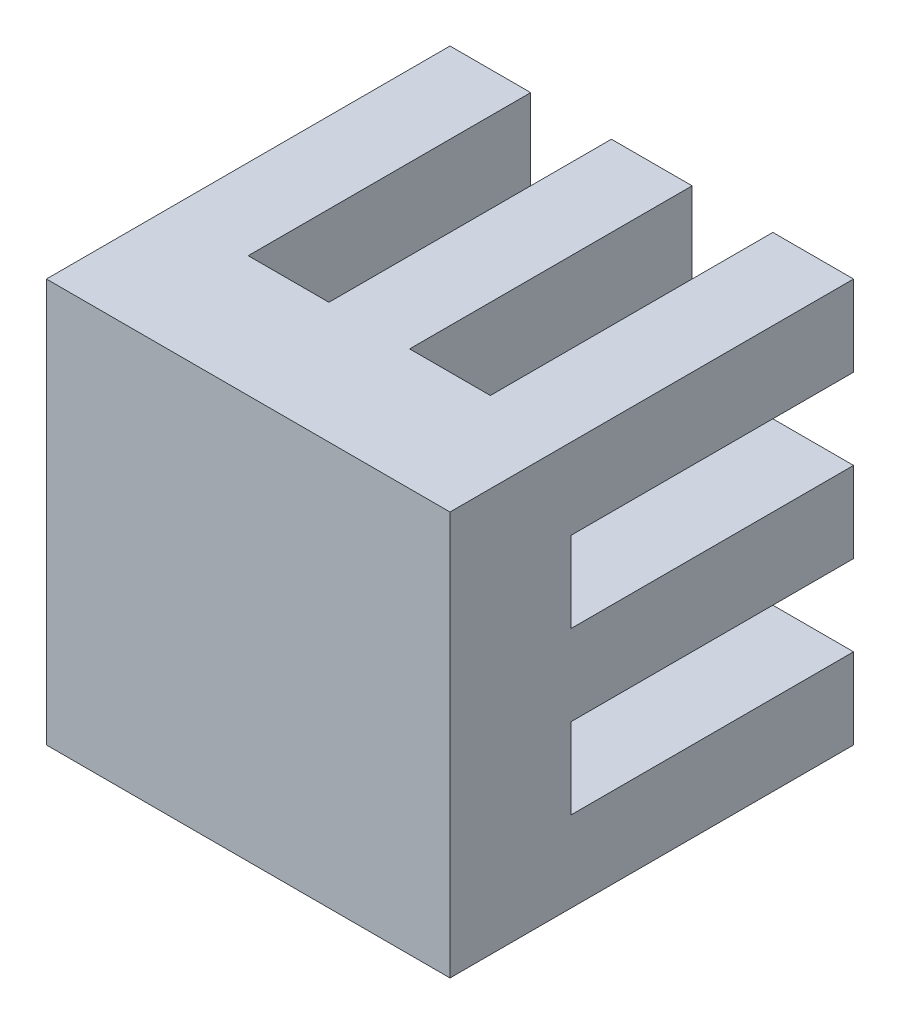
ISO-10303-21;
HEADER;
FILE_DESCRIPTION(('STEP AP214'),'2;1');
FILE_NAME('part.step','',(''),(''),'','','');
FILE_SCHEMA(('AUTOMOTIVE_DESIGN { 1 0 10303 214 1 1 1 1 }'));
ENDSEC;
DATA;
#1=APPLICATION_CONTEXT('core data for automotive mechanical design processes');
#2=APPLICATION_PROTOCOL_DEFINITION('international standard','automotive_design',2000,#1);
#3=PRODUCT_CONTEXT('',#1,'mechanical');
#4=PRODUCT('Part','Part','',(#3));
#5=PRODUCT_RELATED_PRODUCT_CATEGORY('part','',(#4));
#6=PRODUCT_DEFINITION_FORMATION('','',#4);
#7=PRODUCT_DEFINITION_CONTEXT('part definition',#1,'design');
#8=PRODUCT_DEFINITION('design','',#6,#7);
#9=PRODUCT_DEFINITION_SHAPE('','',#8);
#10=(LENGTH_UNIT() NAMED_UNIT(*) SI_UNIT(.MILLI.,.METRE.));
#11=(NAMED_UNIT(*) PLANE_ANGLE_UNIT() SI_UNIT($,.RADIAN.));
#12=(NAMED_UNIT(*) SI_UNIT($,.STERADIAN.) SOLID_ANGLE_UNIT());
#13=UNCERTAINTY_MEASURE_WITH_UNIT(LENGTH_MEASURE(1.E-05),#10,'distance_accuracy_value','');
#14=(GEOMETRIC_REPRESENTATION_CONTEXT(3) GLOBAL_UNCERTAINTY_ASSIGNED_CONTEXT((#13)) GLOBAL_UNIT_ASSIGNED_CONTEXT((#10,
#11,#12)) REPRESENTATION_CONTEXT('',''));
#15=CARTESIAN_POINT('',(0.,0.,0.));
#16=DIRECTION('',(0.,0.,1.));
#17=DIRECTION('',(1.,0.,0.));
#18=AXIS2_PLACEMENT_3D('',#15,#16,#17);
#19=CARTESIAN_POINT('',(0.,10.,0.));
#20=DIRECTION('',(0.,0.,1.));
#21=DIRECTION('',(1.,0.,0.));
#22=AXIS2_PLACEMENT_3D('',#19,#20,#21);
#23=PLANE('',#22);
#24=DIRECTION('',(0.,1.,0.));
#25=VECTOR('',#24,1.);
#26=CARTESIAN_POINT('',(6.,0.,0.));
#27=LINE('',#26,#25);
#28=CARTESIAN_POINT('',(6.,8.,0.));
#29=VERTEX_POINT('',#28);
#30=CARTESIAN_POINT('',(6.,10.,0.));
#31=VERTEX_POINT('',#30);
#32=EDGE_CURVE('E405',#29,#31,#27,.T.);
#33=ORIENTED_EDGE('',*,*,#32,.F.);
#34=DIRECTION('',(1.,0.,0.));
#35=VECTOR('',#34,1.);
#36=CARTESIAN_POINT('',(10.,8.,0.));
#37=LINE('',#36,#35);
#38=CARTESIAN_POINT('',(4.,8.,0.));
#39=VERTEX_POINT('',#38);
#40=EDGE_CURVE('E554',#39,#29,#37,.T.);
#41=ORIENTED_EDGE('',*,*,#40,.F.);
#42=DIRECTION('',(0.,1.,0.));
#43=VECTOR('',#42,1.);
#44=CARTESIAN_POINT('',(4.,0.,0.));
#45=LINE('',#44,#43);
#46=CARTESIAN_POINT('',(4.,10.,0.));
#47=VERTEX_POINT('',#46);
#48=EDGE_CURVE('E448',#39,#47,#45,.T.);
#49=ORIENTED_EDGE('',*,*,#48,.T.);
#50=DIRECTION('',(-1.,0.,0.));
#51=VECTOR('',#50,1.);
#52=CARTESIAN_POINT('',(0.,10.,0.));
#53=LINE('',#52,#51);
#54=EDGE_CURVE('E471',#31,#47,#53,.T.);
#55=ORIENTED_EDGE('',*,*,#54,.F.);
#56=EDGE_LOOP('',(#33,#41,#49,#55));
#57=FACE_BOUND('',#56,.T.);
#58=ADVANCED_FACE('F34',(#57),#23,.F.);
#59=DIRECTION('',(0.,1.,0.));
#60=VECTOR('',#59,1.);
#61=CARTESIAN_POINT('',(2.,0.,0.));
#62=LINE('',#61,#60);
#63=CARTESIAN_POINT('',(2.,8.,0.));
#64=VERTEX_POINT('',#63);
#65=CARTESIAN_POINT('',(2.,10.,0.));
#66=VERTEX_POINT('',#65);
#67=EDGE_CURVE('E443',#64,#66,#62,.T.);
#68=ORIENTED_EDGE('',*,*,#67,.F.);
#69=CARTESIAN_POINT('',(0.,8.,0.));
#70=VERTEX_POINT('',#69);
#71=EDGE_CURVE('E289',#70,#64,#37,.T.);
#72=ORIENTED_EDGE('',*,*,#71,.F.);
#73=DIRECTION('',(0.,-1.,0.));
#74=VECTOR('',#73,1.);
#75=CARTESIAN_POINT('',(0.,10.,0.));
#76=LINE('',#75,#74);
#77=CARTESIAN_POINT('',(0.,10.,0.));
#78=VERTEX_POINT('',#77);
#79=EDGE_CURVE('E483',#78,#70,#76,.T.);
#80=ORIENTED_EDGE('',*,*,#79,.F.);
#81=EDGE_CURVE('E466',#66,#78,#53,.T.);
#82=ORIENTED_EDGE('',*,*,#81,.F.);
#83=EDGE_LOOP('',(#68,#72,#80,#82));
#84=FACE_BOUND('',#83,.T.);
#85=ADVANCED_FACE('F573',(#84),#23,.F.);
#86=DIRECTION('',(0.,-1.,0.));
#87=VECTOR('',#86,1.);
#88=CARTESIAN_POINT('',(10.,10.,0.));
#89=LINE('',#88,#87);
#90=CARTESIAN_POINT('',(10.,10.,0.));
#91=VERTEX_POINT('',#90);
#92=CARTESIAN_POINT('',(10.,8.,0.));
#93=VERTEX_POINT('',#92);
#94=EDGE_CURVE('E488',#91,#93,#89,.T.);
#95=ORIENTED_EDGE('',*,*,#94,.T.);
#96=CARTESIAN_POINT('',(8.,8.,0.));
#97=VERTEX_POINT('',#96);
#98=EDGE_CURVE('E553',#97,#93,#37,.T.);
#99=ORIENTED_EDGE('',*,*,#98,.F.);
#100=DIRECTION('',(0.,1.,0.));
#101=VECTOR('',#100,1.);
#102=CARTESIAN_POINT('',(8.,0.,0.));
#103=LINE('',#102,#101);
#104=CARTESIAN_POINT('',(8.,10.,0.));
#105=VERTEX_POINT('',#104);
#106=EDGE_CURVE('E410',#97,#105,#103,.T.);
#107=ORIENTED_EDGE('',*,*,#106,.T.);
#108=EDGE_CURVE('E467',#91,#105,#53,.T.);
#109=ORIENTED_EDGE('',*,*,#108,.F.);
#110=EDGE_LOOP('',(#95,#99,#107,#109));
#111=FACE_BOUND('',#110,.T.);
#112=ADVANCED_FACE('F552',(#111),#23,.F.);
#113=CARTESIAN_POINT('',(2.,0.,0.));
#114=DIRECTION('',(-1.,0.,0.));
#115=DIRECTION('',(0.,0.,1.));
#116=AXIS2_PLACEMENT_3D('',#113,#114,#115);
#117=PLANE('',#116);
#118=DIRECTION('',(0.,1.,0.));
#119=VECTOR('',#118,1.);
#120=CARTESIAN_POINT('',(2.,0.,7.));
#121=LINE('',#120,#119);
#122=CARTESIAN_POINT('',(2.,8.,7.));
#123=VERTEX_POINT('',#122);
#124=CARTESIAN_POINT('',(2.,10.,7.));
#125=VERTEX_POINT('',#124);
#126=EDGE_CURVE('E430',#123,#125,#121,.T.);
#127=ORIENTED_EDGE('',*,*,#126,.F.);
#128=DIRECTION('',(0.,0.,-1.));
#129=VECTOR('',#128,1.);
#130=CARTESIAN_POINT('',(2.,8.,0.));
#131=LINE('',#130,#129);
#132=EDGE_CURVE('E323',#123,#64,#131,.T.);
#133=ORIENTED_EDGE('',*,*,#132,.T.);
#134=ORIENTED_EDGE('',*,*,#67,.T.);
#135=DIRECTION('',(0.,0.,1.));
#136=VECTOR('',#135,1.);
#137=CARTESIAN_POINT('',(2.,10.,0.));
#138=LINE('',#137,#136);
#139=EDGE_CURVE('E403',#66,#125,#138,.T.);
#140=ORIENTED_EDGE('',*,*,#139,.T.);
#141=EDGE_LOOP('',(#127,#133,#134,#140));
#142=FACE_BOUND('',#141,.T.);
#143=ADVANCED_FACE('F570',(#142),#117,.F.);
#144=CARTESIAN_POINT('',(4.,0.,0.));
#145=DIRECTION('',(1.,0.,0.));
#146=DIRECTION('',(0.,0.,-1.));
#147=AXIS2_PLACEMENT_3D('',#144,#145,#146);
#148=PLANE('',#147);
#149=ORIENTED_EDGE('',*,*,#48,.F.);
#150=DIRECTION('',(0.,0.,1.));
#151=VECTOR('',#150,1.);
#152=CARTESIAN_POINT('',(4.,8.,0.));
#153=LINE('',#152,#151);
#154=CARTESIAN_POINT('',(4.,8.,7.));
#155=VERTEX_POINT('',#154);
#156=EDGE_CURVE('E320',#39,#155,#153,.T.);
#157=ORIENTED_EDGE('',*,*,#156,.T.);
#158=DIRECTION('',(0.,1.,0.));
#159=VECTOR('',#158,1.);
#160=CARTESIAN_POINT('',(4.,0.,7.));
#161=LINE('',#160,#159);
#162=CARTESIAN_POINT('',(4.,10.,7.));
#163=VERTEX_POINT('',#162);
#164=EDGE_CURVE('E453',#155,#163,#161,.T.);
#165=ORIENTED_EDGE('',*,*,#164,.T.);
#166=DIRECTION('',(0.,0.,-1.));
#167=VECTOR('',#166,1.);
#168=CARTESIAN_POINT('',(4.,10.,0.));
#169=LINE('',#168,#167);
#170=EDGE_CURVE('E424',#163,#47,#169,.T.);
#171=ORIENTED_EDGE('',*,*,#170,.T.);
#172=EDGE_LOOP('',(#149,#157,#165,#171));
#173=FACE_BOUND('',#172,.T.);
#174=ADVANCED_FACE('F596',(#173),#148,.F.);
#175=CARTESIAN_POINT('',(6.,0.,0.));
#176=DIRECTION('',(-1.,0.,0.));
#177=DIRECTION('',(0.,0.,1.));
#178=AXIS2_PLACEMENT_3D('',#175,#176,#177);
#179=PLANE('',#178);
#180=DIRECTION('',(0.,1.,0.));
#181=VECTOR('',#180,1.);
#182=CARTESIAN_POINT('',(6.,0.,7.));
#183=LINE('',#182,#181);
#184=CARTESIAN_POINT('',(6.,8.,7.));
#185=VERTEX_POINT('',#184);
#186=CARTESIAN_POINT('',(6.,10.,7.));
#187=VERTEX_POINT('',#186);
#188=EDGE_CURVE('E392',#185,#187,#183,.T.);
#189=ORIENTED_EDGE('',*,*,#188,.F.);
#190=DIRECTION('',(0.,0.,-1.));
#191=VECTOR('',#190,1.);
#192=CARTESIAN_POINT('',(6.,8.,0.));
#193=LINE('',#192,#191);
#194=EDGE_CURVE('E317',#185,#29,#193,.T.);
#195=ORIENTED_EDGE('',*,*,#194,.T.);
#196=ORIENTED_EDGE('',*,*,#32,.T.);
#197=DIRECTION('',(0.,0.,1.));
#198=VECTOR('',#197,1.);
#199=CARTESIAN_POINT('',(6.,10.,0.));
#200=LINE('',#199,#198);
#201=EDGE_CURVE('E381',#31,#187,#200,.T.);
#202=ORIENTED_EDGE('',*,*,#201,.T.);
#203=EDGE_LOOP('',(#189,#195,#196,#202));
#204=FACE_BOUND('',#203,.T.);
#205=ADVANCED_FACE('F538',(#204),#179,.F.);
#206=CARTESIAN_POINT('',(8.,0.,0.));
#207=DIRECTION('',(1.,0.,0.));
#208=DIRECTION('',(0.,0.,-1.));
#209=AXIS2_PLACEMENT_3D('',#206,#207,#208);
#210=PLANE('',#209);
#211=ORIENTED_EDGE('',*,*,#106,.F.);
#212=DIRECTION('',(0.,0.,1.));
#213=VECTOR('',#212,1.);
#214=CARTESIAN_POINT('',(8.,8.,0.));
#215=LINE('',#214,#213);
#216=CARTESIAN_POINT('',(8.,8.,7.));
#217=VERTEX_POINT('',#216);
#218=EDGE_CURVE('E314',#97,#217,#215,.T.);
#219=ORIENTED_EDGE('',*,*,#218,.T.);
#220=DIRECTION('',(0.,1.,0.));
#221=VECTOR('',#220,1.);
#222=CARTESIAN_POINT('',(8.,0.,7.));
#223=LINE('',#222,#221);
#224=CARTESIAN_POINT('',(8.,10.,7.));
#225=VERTEX_POINT('',#224);
#226=EDGE_CURVE('E415',#217,#225,#223,.T.);
#227=ORIENTED_EDGE('',*,*,#226,.T.);
#228=DIRECTION('',(0.,0.,-1.));
#229=VECTOR('',#228,1.);
#230=CARTESIAN_POINT('',(8.,10.,0.));
#231=LINE('',#230,#229);
#232=EDGE_CURVE('E386',#225,#105,#231,.T.);
#233=ORIENTED_EDGE('',*,*,#232,.T.);
#234=EDGE_LOOP('',(#211,#219,#227,#233));
#235=FACE_BOUND('',#234,.T.);
#236=ADVANCED_FACE('F547',(#235),#210,.F.);
#237=CARTESIAN_POINT('',(4.,4.,0.));
#238=VERTEX_POINT('',#237);
#239=CARTESIAN_POINT('',(4.,6.,0.));
#240=VERTEX_POINT('',#239);
#241=EDGE_CURVE('E447',#238,#240,#45,.T.);
#242=ORIENTED_EDGE('',*,*,#241,.T.);
#243=DIRECTION('',(-1.,0.,0.));
#244=VECTOR('',#243,1.);
#245=CARTESIAN_POINT('',(10.,6.,0.));
#246=LINE('',#245,#244);
#247=CARTESIAN_POINT('',(6.,6.,0.));
#248=VERTEX_POINT('',#247);
#249=EDGE_CURVE('E556',#248,#240,#246,.T.);
#250=ORIENTED_EDGE('',*,*,#249,.F.);
#251=CARTESIAN_POINT('',(6.,4.,0.));
#252=VERTEX_POINT('',#251);
#253=EDGE_CURVE('E404',#252,#248,#27,.T.);
#254=ORIENTED_EDGE('',*,*,#253,.F.);
#255=DIRECTION('',(1.,0.,0.));
#256=VECTOR('',#255,1.);
#257=CARTESIAN_POINT('',(10.,4.,0.));
#258=LINE('',#257,#256);
#259=EDGE_CURVE('E347',#238,#252,#258,.T.);
#260=ORIENTED_EDGE('',*,*,#259,.F.);
#261=EDGE_LOOP('',(#242,#250,#254,#260));
#262=FACE_BOUND('',#261,.T.);
#263=ADVANCED_FACE('F671',(#262),#23,.F.);
#264=CARTESIAN_POINT('',(0.,6.,0.));
#265=VERTEX_POINT('',#264);
#266=CARTESIAN_POINT('',(0.,4.,0.));
#267=VERTEX_POINT('',#266);
#268=EDGE_CURVE('E487',#265,#267,#76,.T.);
#269=ORIENTED_EDGE('',*,*,#268,.F.);
#270=CARTESIAN_POINT('',(2.,6.,0.));
#271=VERTEX_POINT('',#270);
#272=EDGE_CURVE('E558',#271,#265,#246,.T.);
#273=ORIENTED_EDGE('',*,*,#272,.F.);
#274=CARTESIAN_POINT('',(2.,4.,0.));
#275=VERTEX_POINT('',#274);
#276=EDGE_CURVE('E442',#275,#271,#62,.T.);
#277=ORIENTED_EDGE('',*,*,#276,.F.);
#278=EDGE_CURVE('E331',#267,#275,#258,.T.);
#279=ORIENTED_EDGE('',*,*,#278,.F.);
#280=EDGE_LOOP('',(#269,#273,#277,#279));
#281=FACE_BOUND('',#280,.T.);
#282=ADVANCED_FACE('F585',(#281),#23,.F.);
#283=CARTESIAN_POINT('',(8.,4.,0.));
#284=VERTEX_POINT('',#283);
#285=CARTESIAN_POINT('',(8.,6.,0.));
#286=VERTEX_POINT('',#285);
#287=EDGE_CURVE('E409',#284,#286,#103,.T.);
#288=ORIENTED_EDGE('',*,*,#287,.T.);
#289=CARTESIAN_POINT('',(10.,6.,0.));
#290=VERTEX_POINT('',#289);
#291=EDGE_CURVE('E512',#290,#286,#246,.T.);
#292=ORIENTED_EDGE('',*,*,#291,.F.);
#293=CARTESIAN_POINT('',(10.,4.,0.));
#294=VERTEX_POINT('',#293);
#295=EDGE_CURVE('E294',#290,#294,#89,.T.);
#296=ORIENTED_EDGE('',*,*,#295,.T.);
#297=EDGE_CURVE('E344',#284,#294,#258,.T.);
#298=ORIENTED_EDGE('',*,*,#297,.F.);
#299=EDGE_LOOP('',(#288,#292,#296,#298));
#300=FACE_BOUND('',#299,.T.);
#301=ADVANCED_FACE('F510',(#300),#23,.F.);
#302=ORIENTED_EDGE('',*,*,#276,.T.);
#303=DIRECTION('',(0.,0.,1.));
#304=VECTOR('',#303,1.);
#305=CARTESIAN_POINT('',(2.,6.,0.));
#306=LINE('',#305,#304);
#307=CARTESIAN_POINT('',(2.,6.,7.));
#308=VERTEX_POINT('',#307);
#309=EDGE_CURVE('E311',#271,#308,#306,.T.);
#310=ORIENTED_EDGE('',*,*,#309,.T.);
#311=CARTESIAN_POINT('',(2.,4.,7.));
#312=VERTEX_POINT('',#311);
#313=EDGE_CURVE('E457',#312,#308,#121,.T.);
#314=ORIENTED_EDGE('',*,*,#313,.F.);
#315=DIRECTION('',(0.,0.,-1.));
#316=VECTOR('',#315,1.);
#317=CARTESIAN_POINT('',(2.,4.,0.));
#318=LINE('',#317,#316);
#319=EDGE_CURVE('E378',#312,#275,#318,.T.);
#320=ORIENTED_EDGE('',*,*,#319,.T.);
#321=EDGE_LOOP('',(#302,#310,#314,#320));
#322=FACE_BOUND('',#321,.T.);
#323=ADVANCED_FACE('F577',(#322),#117,.F.);
#324=CARTESIAN_POINT('',(4.,4.,7.));
#325=VERTEX_POINT('',#324);
#326=CARTESIAN_POINT('',(4.,6.,7.));
#327=VERTEX_POINT('',#326);
#328=EDGE_CURVE('E452',#325,#327,#161,.T.);
#329=ORIENTED_EDGE('',*,*,#328,.T.);
#330=DIRECTION('',(0.,0.,-1.));
#331=VECTOR('',#330,1.);
#332=CARTESIAN_POINT('',(4.,6.,0.));
#333=LINE('',#332,#331);
#334=EDGE_CURVE('E308',#327,#240,#333,.T.);
#335=ORIENTED_EDGE('',*,*,#334,.T.);
#336=ORIENTED_EDGE('',*,*,#241,.F.);
#337=DIRECTION('',(0.,0.,1.));
#338=VECTOR('',#337,1.);
#339=CARTESIAN_POINT('',(4.,4.,0.));
#340=LINE('',#339,#338);
#341=EDGE_CURVE('E375',#238,#325,#340,.T.);
#342=ORIENTED_EDGE('',*,*,#341,.T.);
#343=EDGE_LOOP('',(#329,#335,#336,#342));
#344=FACE_BOUND('',#343,.T.);
#345=ADVANCED_FACE('F668',(#344),#148,.F.);
#346=ORIENTED_EDGE('',*,*,#253,.T.);
#347=DIRECTION('',(0.,0.,1.));
#348=VECTOR('',#347,1.);
#349=CARTESIAN_POINT('',(6.,6.,0.));
#350=LINE('',#349,#348);
#351=CARTESIAN_POINT('',(6.,6.,7.));
#352=VERTEX_POINT('',#351);
#353=EDGE_CURVE('E305',#248,#352,#350,.T.);
#354=ORIENTED_EDGE('',*,*,#353,.T.);
#355=CARTESIAN_POINT('',(6.,4.,7.));
#356=VERTEX_POINT('',#355);
#357=EDGE_CURVE('E419',#356,#352,#183,.T.);
#358=ORIENTED_EDGE('',*,*,#357,.F.);
#359=DIRECTION('',(0.,0.,-1.));
#360=VECTOR('',#359,1.);
#361=CARTESIAN_POINT('',(6.,4.,0.));
#362=LINE('',#361,#360);
#363=EDGE_CURVE('E372',#356,#252,#362,.T.);
#364=ORIENTED_EDGE('',*,*,#363,.T.);
#365=EDGE_LOOP('',(#346,#354,#358,#364));
#366=FACE_BOUND('',#365,.T.);
#367=ADVANCED_FACE('F531',(#366),#179,.F.);
#368=CARTESIAN_POINT('',(8.,4.,7.));
#369=VERTEX_POINT('',#368);
#370=CARTESIAN_POINT('',(8.,6.,7.));
#371=VERTEX_POINT('',#370);
#372=EDGE_CURVE('E414',#369,#371,#223,.T.);
#373=ORIENTED_EDGE('',*,*,#372,.T.);
#374=DIRECTION('',(0.,0.,-1.));
#375=VECTOR('',#374,1.);
#376=CARTESIAN_POINT('',(8.,6.,0.));
#377=LINE('',#376,#375);
#378=EDGE_CURVE('E273',#371,#286,#377,.T.);
#379=ORIENTED_EDGE('',*,*,#378,.T.);
#380=ORIENTED_EDGE('',*,*,#287,.F.);
#381=DIRECTION('',(0.,0.,1.));
#382=VECTOR('',#381,1.);
#383=CARTESIAN_POINT('',(8.,4.,0.));
#384=LINE('',#383,#382);
#385=EDGE_CURVE('E369',#284,#369,#384,.T.);
#386=ORIENTED_EDGE('',*,*,#385,.T.);
#387=EDGE_LOOP('',(#373,#379,#380,#386));
#388=FACE_BOUND('',#387,.T.);
#389=ADVANCED_FACE('F549',(#388),#210,.F.);
#390=CARTESIAN_POINT('',(4.,0.,0.));
#391=VERTEX_POINT('',#390);
#392=CARTESIAN_POINT('',(4.,2.,0.));
#393=VERTEX_POINT('',#392);
#394=EDGE_CURVE('E444',#391,#393,#45,.T.);
#395=ORIENTED_EDGE('',*,*,#394,.T.);
#396=DIRECTION('',(-1.,0.,0.));
#397=VECTOR('',#396,1.);
#398=CARTESIAN_POINT('',(10.,2.,0.));
#399=LINE('',#398,#397);
#400=CARTESIAN_POINT('',(6.,2.,0.));
#401=VERTEX_POINT('',#400);
#402=EDGE_CURVE('E345',#401,#393,#399,.T.);
#403=ORIENTED_EDGE('',*,*,#402,.F.);
#404=CARTESIAN_POINT('',(6.,0.,0.));
#405=VERTEX_POINT('',#404);
#406=EDGE_CURVE('E400',#405,#401,#27,.T.);
#407=ORIENTED_EDGE('',*,*,#406,.F.);
#408=DIRECTION('',(-1.,0.,0.));
#409=VECTOR('',#408,1.);
#410=CARTESIAN_POINT('',(0.,0.,0.));
#411=LINE('',#410,#409);
#412=EDGE_CURVE('E482',#405,#391,#411,.T.);
#413=ORIENTED_EDGE('',*,*,#412,.T.);
#414=EDGE_LOOP('',(#395,#403,#407,#413));
#415=FACE_BOUND('',#414,.T.);
#416=ADVANCED_FACE('F613',(#415),#23,.F.);
#417=CARTESIAN_POINT('',(0.,2.,0.));
#418=VERTEX_POINT('',#417);
#419=CARTESIAN_POINT('',(0.,0.,0.));
#420=VERTEX_POINT('',#419);
#421=EDGE_CURVE('E470',#418,#420,#76,.T.);
#422=ORIENTED_EDGE('',*,*,#421,.F.);
#423=CARTESIAN_POINT('',(2.,2.,0.));
#424=VERTEX_POINT('',#423);
#425=EDGE_CURVE('E326',#424,#418,#399,.T.);
#426=ORIENTED_EDGE('',*,*,#425,.F.);
#427=CARTESIAN_POINT('',(2.,0.,0.));
#428=VERTEX_POINT('',#427);
#429=EDGE_CURVE('E438',#428,#424,#62,.T.);
#430=ORIENTED_EDGE('',*,*,#429,.F.);
#431=EDGE_CURVE('E479',#428,#420,#411,.T.);
#432=ORIENTED_EDGE('',*,*,#431,.T.);
#433=EDGE_LOOP('',(#422,#426,#430,#432));
#434=FACE_BOUND('',#433,.T.);
#435=ADVANCED_FACE('F609',(#434),#23,.F.);
#436=CARTESIAN_POINT('',(0.,10.,0.));
#437=DIRECTION('',(1.,0.,0.));
#438=DIRECTION('',(0.,0.,-1.));
#439=AXIS2_PLACEMENT_3D('',#436,#437,#438);
#440=PLANE('',#439);
#441=ORIENTED_EDGE('',*,*,#79,.T.);
#442=DIRECTION('',(0.,0.,-1.));
#443=VECTOR('',#442,1.);
#444=CARTESIAN_POINT('',(0.,8.,7.));
#445=LINE('',#444,#443);
#446=CARTESIAN_POINT('',(0.,8.,7.));
#447=VERTEX_POINT('',#446);
#448=EDGE_CURVE('E297',#447,#70,#445,.T.);
#449=ORIENTED_EDGE('',*,*,#448,.F.);
#450=DIRECTION('',(0.,1.,0.));
#451=VECTOR('',#450,1.);
#452=CARTESIAN_POINT('',(0.,8.,7.));
#453=LINE('',#452,#451);
#454=CARTESIAN_POINT('',(0.,6.,7.));
#455=VERTEX_POINT('',#454);
#456=EDGE_CURVE('E277',#455,#447,#453,.T.);
#457=ORIENTED_EDGE('',*,*,#456,.F.);
#458=DIRECTION('',(0.,0.,-1.));
#459=VECTOR('',#458,1.);
#460=CARTESIAN_POINT('',(0.,6.,7.));
#461=LINE('',#460,#459);
#462=EDGE_CURVE('E49',#455,#265,#461,.T.);
#463=ORIENTED_EDGE('',*,*,#462,.T.);
#464=ORIENTED_EDGE('',*,*,#268,.T.);
#465=DIRECTION('',(0.,0.,-1.));
#466=VECTOR('',#465,1.);
#467=CARTESIAN_POINT('',(0.,4.,7.));
#468=LINE('',#467,#466);
#469=CARTESIAN_POINT('',(0.,4.,7.));
#470=VERTEX_POINT('',#469);
#471=EDGE_CURVE('E351',#470,#267,#468,.T.);
#472=ORIENTED_EDGE('',*,*,#471,.F.);
#473=DIRECTION('',(0.,1.,0.));
#474=VECTOR('',#473,1.);
#475=CARTESIAN_POINT('',(0.,4.,7.));
#476=LINE('',#475,#474);
#477=CARTESIAN_POINT('',(0.,2.,7.));
#478=VERTEX_POINT('',#477);
#479=EDGE_CURVE('E334',#478,#470,#476,.T.);
#480=ORIENTED_EDGE('',*,*,#479,.F.);
#481=DIRECTION('',(0.,0.,-1.));
#482=VECTOR('',#481,1.);
#483=CARTESIAN_POINT('',(0.,2.,7.));
#484=LINE('',#483,#482);
#485=EDGE_CURVE('E354',#478,#418,#484,.T.);
#486=ORIENTED_EDGE('',*,*,#485,.T.);
#487=ORIENTED_EDGE('',*,*,#421,.T.);
#488=DIRECTION('',(0.,0.,1.));
#489=VECTOR('',#488,1.);
#490=CARTESIAN_POINT('',(0.,0.,0.));
#491=LINE('',#490,#489);
#492=CARTESIAN_POINT('',(0.,0.,10.));
#493=VERTEX_POINT('',#492);
#494=EDGE_CURVE('E441',#420,#493,#491,.T.);
#495=ORIENTED_EDGE('',*,*,#494,.T.);
#496=DIRECTION('',(0.,-1.,0.));
#497=VECTOR('',#496,1.);
#498=CARTESIAN_POINT('',(0.,10.,10.));
#499=LINE('',#498,#497);
#500=CARTESIAN_POINT('',(0.,10.,10.));
#501=VERTEX_POINT('',#500);
#502=EDGE_CURVE('E11',#501,#493,#499,.T.);
#503=ORIENTED_EDGE('',*,*,#502,.F.);
#504=DIRECTION('',(0.,0.,1.));
#505=VECTOR('',#504,1.);
#506=CARTESIAN_POINT('',(0.,10.,0.));
#507=LINE('',#506,#505);
#508=EDGE_CURVE('E458',#78,#501,#507,.T.);
#509=ORIENTED_EDGE('',*,*,#508,.F.);
#510=EDGE_LOOP('',(#441,#449,#457,#463,#464,#472,#480,#486,#487,#495,#503,#509));
#511=FACE_BOUND('',#510,.T.);
#512=ADVANCED_FACE('F36',(#511),#440,.F.);
#513=CARTESIAN_POINT('',(0.,10.,10.));
#514=DIRECTION('',(0.,0.,-1.));
#515=DIRECTION('',(-1.,0.,0.));
#516=AXIS2_PLACEMENT_3D('',#513,#514,#515);
#517=PLANE('',#516);
#518=DIRECTION('',(1.,0.,0.));
#519=VECTOR('',#518,1.);
#520=CARTESIAN_POINT('',(0.,0.,10.));
#521=LINE('',#520,#519);
#522=CARTESIAN_POINT('',(10.,0.,10.));
#523=VERTEX_POINT('',#522);
#524=EDGE_CURVE('E474',#493,#523,#521,.T.);
#525=ORIENTED_EDGE('',*,*,#524,.T.);
#526=DIRECTION('',(0.,-1.,0.));
#527=VECTOR('',#526,1.);
#528=CARTESIAN_POINT('',(10.,10.,10.));
#529=LINE('',#528,#527);
#530=CARTESIAN_POINT('',(10.,10.,10.));
#531=VERTEX_POINT('',#530);
#532=EDGE_CURVE('E42',#531,#523,#529,.T.);
#533=ORIENTED_EDGE('',*,*,#532,.F.);
#534=DIRECTION('',(1.,0.,0.));
#535=VECTOR('',#534,1.);
#536=CARTESIAN_POINT('',(0.,10.,10.));
#537=LINE('',#536,#535);
#538=EDGE_CURVE('E461',#501,#531,#537,.T.);
#539=ORIENTED_EDGE('',*,*,#538,.F.);
#540=ORIENTED_EDGE('',*,*,#502,.T.);
#541=EDGE_LOOP('',(#525,#533,#539,#540));
#542=FACE_BOUND('',#541,.T.);
#543=ADVANCED_FACE('F654',(#542),#517,.F.);
#544=CARTESIAN_POINT('',(10.,10.,0.));
#545=DIRECTION('',(-1.,0.,0.));
#546=DIRECTION('',(0.,0.,1.));
#547=AXIS2_PLACEMENT_3D('',#544,#545,#546);
#548=PLANE('',#547);
#549=DIRECTION('',(0.,-1.,0.));
#550=VECTOR('',#549,1.);
#551=CARTESIAN_POINT('',(10.,8.,7.));
#552=LINE('',#551,#550);
#553=CARTESIAN_POINT('',(10.,8.,7.));
#554=VERTEX_POINT('',#553);
#555=CARTESIAN_POINT('',(10.,6.,7.));
#556=VERTEX_POINT('',#555);
#557=EDGE_CURVE('E282',#554,#556,#552,.T.);
#558=ORIENTED_EDGE('',*,*,#557,.F.);
#559=DIRECTION('',(0.,0.,-1.));
#560=VECTOR('',#559,1.);
#561=CARTESIAN_POINT('',(10.,8.,7.));
#562=LINE('',#561,#560);
#563=EDGE_CURVE('E57',#554,#93,#562,.T.);
#564=ORIENTED_EDGE('',*,*,#563,.T.);
#565=ORIENTED_EDGE('',*,*,#94,.F.);
#566=DIRECTION('',(0.,0.,-1.));
#567=VECTOR('',#566,1.);
#568=CARTESIAN_POINT('',(10.,10.,0.));
#569=LINE('',#568,#567);
#570=EDGE_CURVE('E464',#531,#91,#569,.T.);
#571=ORIENTED_EDGE('',*,*,#570,.F.);
#572=ORIENTED_EDGE('',*,*,#532,.T.);
#573=DIRECTION('',(0.,0.,-1.));
#574=VECTOR('',#573,1.);
#575=CARTESIAN_POINT('',(10.,0.,0.));
#576=LINE('',#575,#574);
#577=CARTESIAN_POINT('',(10.,0.,0.));
#578=VERTEX_POINT('',#577);
#579=EDGE_CURVE('E476',#523,#578,#576,.T.);
#580=ORIENTED_EDGE('',*,*,#579,.T.);
#581=CARTESIAN_POINT('',(10.,2.,0.));
#582=VERTEX_POINT('',#581);
#583=EDGE_CURVE('E486',#582,#578,#89,.T.);
#584=ORIENTED_EDGE('',*,*,#583,.F.);
#585=DIRECTION('',(0.,0.,-1.));
#586=VECTOR('',#585,1.);
#587=CARTESIAN_POINT('',(10.,2.,7.));
#588=LINE('',#587,#586);
#589=CARTESIAN_POINT('',(10.,2.,7.));
#590=VERTEX_POINT('',#589);
#591=EDGE_CURVE('E340',#590,#582,#588,.T.);
#592=ORIENTED_EDGE('',*,*,#591,.F.);
#593=DIRECTION('',(0.,-1.,0.));
#594=VECTOR('',#593,1.);
#595=CARTESIAN_POINT('',(10.,4.,7.));
#596=LINE('',#595,#594);
#597=CARTESIAN_POINT('',(10.,4.,7.));
#598=VERTEX_POINT('',#597);
#599=EDGE_CURVE('E327',#598,#590,#596,.T.);
#600=ORIENTED_EDGE('',*,*,#599,.F.);
#601=DIRECTION('',(0.,0.,-1.));
#602=VECTOR('',#601,1.);
#603=CARTESIAN_POINT('',(10.,4.,7.));
#604=LINE('',#603,#602);
#605=EDGE_CURVE('E348',#598,#294,#604,.T.);
#606=ORIENTED_EDGE('',*,*,#605,.T.);
#607=ORIENTED_EDGE('',*,*,#295,.F.);
#608=DIRECTION('',(0.,0.,-1.));
#609=VECTOR('',#608,1.);
#610=CARTESIAN_POINT('',(10.,6.,7.));
#611=LINE('',#610,#609);
#612=EDGE_CURVE('E270',#556,#290,#611,.T.);
#613=ORIENTED_EDGE('',*,*,#612,.F.);
#614=EDGE_LOOP('',(#558,#564,#565,#571,#572,#580,#584,#592,#600,#606,#607,#613));
#615=FACE_BOUND('',#614,.T.);
#616=ADVANCED_FACE('F292',(#615),#548,.F.);
#617=CARTESIAN_POINT('',(8.,0.,0.));
#618=VERTEX_POINT('',#617);
#619=CARTESIAN_POINT('',(8.,2.,0.));
#620=VERTEX_POINT('',#619);
#621=EDGE_CURVE('E406',#618,#620,#103,.T.);
#622=ORIENTED_EDGE('',*,*,#621,.T.);
#623=EDGE_CURVE('E342',#582,#620,#399,.T.);
#624=ORIENTED_EDGE('',*,*,#623,.F.);
#625=ORIENTED_EDGE('',*,*,#583,.T.);
#626=EDGE_CURVE('E462',#578,#618,#411,.T.);
#627=ORIENTED_EDGE('',*,*,#626,.T.);
#628=EDGE_LOOP('',(#622,#624,#625,#627));
#629=FACE_BOUND('',#628,.T.);
#630=ADVANCED_FACE('F503',(#629),#23,.F.);
#631=CARTESIAN_POINT('',(0.,10.,0.));
#632=DIRECTION('',(0.,1.,0.));
#633=DIRECTION('',(0.,0.,1.));
#634=AXIS2_PLACEMENT_3D('',#631,#632,#633);
#635=PLANE('',#634);
#636=ORIENTED_EDGE('',*,*,#201,.F.);
#637=ORIENTED_EDGE('',*,*,#54,.T.);
#638=ORIENTED_EDGE('',*,*,#170,.F.);
#639=DIRECTION('',(1.,0.,0.));
#640=VECTOR('',#639,1.);
#641=CARTESIAN_POINT('',(2.,10.,7.));
#642=LINE('',#641,#640);
#643=EDGE_CURVE('E433',#125,#163,#642,.T.);
#644=ORIENTED_EDGE('',*,*,#643,.F.);
#645=ORIENTED_EDGE('',*,*,#139,.F.);
#646=ORIENTED_EDGE('',*,*,#81,.T.);
#647=ORIENTED_EDGE('',*,*,#508,.T.);
#648=ORIENTED_EDGE('',*,*,#538,.T.);
#649=ORIENTED_EDGE('',*,*,#570,.T.);
#650=ORIENTED_EDGE('',*,*,#108,.T.);
#651=ORIENTED_EDGE('',*,*,#232,.F.);
#652=DIRECTION('',(1.,0.,0.));
#653=VECTOR('',#652,1.);
#654=CARTESIAN_POINT('',(6.,10.,7.));
#655=LINE('',#654,#653);
#656=EDGE_CURVE('E395',#187,#225,#655,.T.);
#657=ORIENTED_EDGE('',*,*,#656,.F.);
#658=EDGE_LOOP('',(#636,#637,#638,#644,#645,#646,#647,#648,#649,#650,#651,#657));
#659=FACE_BOUND('',#658,.T.);
#660=ADVANCED_FACE('F543',(#659),#635,.T.);
#661=CARTESIAN_POINT('',(0.,0.,0.));
#662=DIRECTION('',(0.,1.,0.));
#663=DIRECTION('',(0.,0.,1.));
#664=AXIS2_PLACEMENT_3D('',#661,#662,#663);
#665=PLANE('',#664);
#666=ORIENTED_EDGE('',*,*,#412,.F.);
#667=DIRECTION('',(0.,0.,1.));
#668=VECTOR('',#667,1.);
#669=CARTESIAN_POINT('',(6.,0.,0.));
#670=LINE('',#669,#668);
#671=CARTESIAN_POINT('',(6.,0.,7.));
#672=VERTEX_POINT('',#671);
#673=EDGE_CURVE('E382',#405,#672,#670,.T.);
#674=ORIENTED_EDGE('',*,*,#673,.T.);
#675=DIRECTION('',(1.,0.,0.));
#676=VECTOR('',#675,1.);
#677=CARTESIAN_POINT('',(6.,0.,7.));
#678=LINE('',#677,#676);
#679=CARTESIAN_POINT('',(8.,0.,7.));
#680=VERTEX_POINT('',#679);
#681=EDGE_CURVE('E385',#672,#680,#678,.T.);
#682=ORIENTED_EDGE('',*,*,#681,.T.);
#683=DIRECTION('',(0.,0.,-1.));
#684=VECTOR('',#683,1.);
#685=CARTESIAN_POINT('',(8.,0.,0.));
#686=LINE('',#685,#684);
#687=EDGE_CURVE('E389',#680,#618,#686,.T.);
#688=ORIENTED_EDGE('',*,*,#687,.T.);
#689=ORIENTED_EDGE('',*,*,#626,.F.);
#690=ORIENTED_EDGE('',*,*,#579,.F.);
#691=ORIENTED_EDGE('',*,*,#524,.F.);
#692=ORIENTED_EDGE('',*,*,#494,.F.);
#693=ORIENTED_EDGE('',*,*,#431,.F.);
#694=DIRECTION('',(0.,0.,1.));
#695=VECTOR('',#694,1.);
#696=CARTESIAN_POINT('',(2.,0.,0.));
#697=LINE('',#696,#695);
#698=CARTESIAN_POINT('',(2.,0.,7.));
#699=VERTEX_POINT('',#698);
#700=EDGE_CURVE('E420',#428,#699,#697,.T.);
#701=ORIENTED_EDGE('',*,*,#700,.T.);
#702=DIRECTION('',(1.,0.,0.));
#703=VECTOR('',#702,1.);
#704=CARTESIAN_POINT('',(2.,0.,7.));
#705=LINE('',#704,#703);
#706=CARTESIAN_POINT('',(4.,0.,7.));
#707=VERTEX_POINT('',#706);
#708=EDGE_CURVE('E423',#699,#707,#705,.T.);
#709=ORIENTED_EDGE('',*,*,#708,.T.);
#710=DIRECTION('',(0.,0.,-1.));
#711=VECTOR('',#710,1.);
#712=CARTESIAN_POINT('',(4.,0.,0.));
#713=LINE('',#712,#711);
#714=EDGE_CURVE('E427',#707,#391,#713,.T.);
#715=ORIENTED_EDGE('',*,*,#714,.T.);
#716=EDGE_LOOP('',(#666,#674,#682,#688,#689,#690,#691,#692,#693,#701,#709,#715));
#717=FACE_BOUND('',#716,.T.);
#718=ADVANCED_FACE('F500',(#717),#665,.F.);
#719=ORIENTED_EDGE('',*,*,#429,.T.);
#720=DIRECTION('',(0.,0.,1.));
#721=VECTOR('',#720,1.);
#722=CARTESIAN_POINT('',(2.,2.,0.));
#723=LINE('',#722,#721);
#724=CARTESIAN_POINT('',(2.,2.,7.));
#725=VERTEX_POINT('',#724);
#726=EDGE_CURVE('E366',#424,#725,#723,.T.);
#727=ORIENTED_EDGE('',*,*,#726,.T.);
#728=EDGE_CURVE('E454',#699,#725,#121,.T.);
#729=ORIENTED_EDGE('',*,*,#728,.F.);
#730=ORIENTED_EDGE('',*,*,#700,.F.);
#731=EDGE_LOOP('',(#719,#727,#729,#730));
#732=FACE_BOUND('',#731,.T.);
#733=ADVANCED_FACE('F670',(#732),#117,.F.);
#734=CARTESIAN_POINT('',(4.,2.,7.));
#735=VERTEX_POINT('',#734);
#736=EDGE_CURVE('E449',#707,#735,#161,.T.);
#737=ORIENTED_EDGE('',*,*,#736,.T.);
#738=DIRECTION('',(0.,0.,-1.));
#739=VECTOR('',#738,1.);
#740=CARTESIAN_POINT('',(4.,2.,0.));
#741=LINE('',#740,#739);
#742=EDGE_CURVE('E363',#735,#393,#741,.T.);
#743=ORIENTED_EDGE('',*,*,#742,.T.);
#744=ORIENTED_EDGE('',*,*,#394,.F.);
#745=ORIENTED_EDGE('',*,*,#714,.F.);
#746=EDGE_LOOP('',(#737,#743,#744,#745));
#747=FACE_BOUND('',#746,.T.);
#748=ADVANCED_FACE('F616',(#747),#148,.F.);
#749=CARTESIAN_POINT('',(2.,0.,7.));
#750=DIRECTION('',(0.,0.,1.));
#751=DIRECTION('',(1.,0.,0.));
#752=AXIS2_PLACEMENT_3D('',#749,#750,#751);
#753=PLANE('',#752);
#754=ORIENTED_EDGE('',*,*,#164,.F.);
#755=DIRECTION('',(1.,0.,0.));
#756=VECTOR('',#755,1.);
#757=CARTESIAN_POINT('',(10.,8.,7.));
#758=LINE('',#757,#756);
#759=EDGE_CURVE('E300',#155,#185,#758,.T.);
#760=ORIENTED_EDGE('',*,*,#759,.T.);
#761=ORIENTED_EDGE('',*,*,#188,.T.);
#762=ORIENTED_EDGE('',*,*,#656,.T.);
#763=ORIENTED_EDGE('',*,*,#226,.F.);
#764=EDGE_CURVE('E287',#217,#554,#758,.T.);
#765=ORIENTED_EDGE('',*,*,#764,.T.);
#766=ORIENTED_EDGE('',*,*,#557,.T.);
#767=DIRECTION('',(-1.,0.,0.));
#768=VECTOR('',#767,1.);
#769=CARTESIAN_POINT('',(10.,6.,7.));
#770=LINE('',#769,#768);
#771=EDGE_CURVE('E266',#556,#371,#770,.T.);
#772=ORIENTED_EDGE('',*,*,#771,.T.);
#773=ORIENTED_EDGE('',*,*,#372,.F.);
#774=DIRECTION('',(1.,0.,0.));
#775=VECTOR('',#774,1.);
#776=CARTESIAN_POINT('',(10.,4.,7.));
#777=LINE('',#776,#775);
#778=EDGE_CURVE('E337',#369,#598,#777,.T.);
#779=ORIENTED_EDGE('',*,*,#778,.T.);
#780=ORIENTED_EDGE('',*,*,#599,.T.);
#781=DIRECTION('',(-1.,0.,0.));
#782=VECTOR('',#781,1.);
#783=CARTESIAN_POINT('',(10.,2.,7.));
#784=LINE('',#783,#782);
#785=CARTESIAN_POINT('',(8.,2.,7.));
#786=VERTEX_POINT('',#785);
#787=EDGE_CURVE('E332',#590,#786,#784,.T.);
#788=ORIENTED_EDGE('',*,*,#787,.T.);
#789=EDGE_CURVE('E411',#680,#786,#223,.T.);
#790=ORIENTED_EDGE('',*,*,#789,.F.);
#791=ORIENTED_EDGE('',*,*,#681,.F.);
#792=CARTESIAN_POINT('',(6.,2.,7.));
#793=VERTEX_POINT('',#792);
#794=EDGE_CURVE('E416',#672,#793,#183,.T.);
#795=ORIENTED_EDGE('',*,*,#794,.T.);
#796=EDGE_CURVE('E335',#793,#735,#784,.T.);
#797=ORIENTED_EDGE('',*,*,#796,.T.);
#798=ORIENTED_EDGE('',*,*,#736,.F.);
#799=ORIENTED_EDGE('',*,*,#708,.F.);
#800=ORIENTED_EDGE('',*,*,#728,.T.);
#801=EDGE_CURVE('E330',#725,#478,#784,.T.);
#802=ORIENTED_EDGE('',*,*,#801,.T.);
#803=ORIENTED_EDGE('',*,*,#479,.T.);
#804=EDGE_CURVE('E338',#470,#312,#777,.T.);
#805=ORIENTED_EDGE('',*,*,#804,.T.);
#806=ORIENTED_EDGE('',*,*,#313,.T.);
#807=EDGE_CURVE('E280',#308,#455,#770,.T.);
#808=ORIENTED_EDGE('',*,*,#807,.T.);
#809=ORIENTED_EDGE('',*,*,#456,.T.);
#810=EDGE_CURVE('E295',#447,#123,#758,.T.);
#811=ORIENTED_EDGE('',*,*,#810,.T.);
#812=ORIENTED_EDGE('',*,*,#126,.T.);
#813=ORIENTED_EDGE('',*,*,#643,.T.);
#814=EDGE_LOOP('',(#754,#760,#761,#762,#763,#765,#766,#772,#773,#779,#780,#788,#790,#791,#795,
#797,#798,#799,#800,#802,#803,#805,#806,#808,#809,#811,#812,#813));
#815=FACE_BOUND('',#814,.T.);
#816=EDGE_CURVE('E278',#352,#327,#770,.T.);
#817=ORIENTED_EDGE('',*,*,#816,.T.);
#818=ORIENTED_EDGE('',*,*,#328,.F.);
#819=EDGE_CURVE('E341',#325,#356,#777,.T.);
#820=ORIENTED_EDGE('',*,*,#819,.T.);
#821=ORIENTED_EDGE('',*,*,#357,.T.);
#822=EDGE_LOOP('',(#817,#818,#820,#821));
#823=FACE_BOUND('',#822,.T.);
#824=ADVANCED_FACE('F284',(#815,#823),#753,.F.);
#825=ORIENTED_EDGE('',*,*,#406,.T.);
#826=DIRECTION('',(0.,0.,1.));
#827=VECTOR('',#826,1.);
#828=CARTESIAN_POINT('',(6.,2.,0.));
#829=LINE('',#828,#827);
#830=EDGE_CURVE('E360',#401,#793,#829,.T.);
#831=ORIENTED_EDGE('',*,*,#830,.T.);
#832=ORIENTED_EDGE('',*,*,#794,.F.);
#833=ORIENTED_EDGE('',*,*,#673,.F.);
#834=EDGE_LOOP('',(#825,#831,#832,#833));
#835=FACE_BOUND('',#834,.T.);
#836=ADVANCED_FACE('F626',(#835),#179,.F.);
#837=ORIENTED_EDGE('',*,*,#789,.T.);
#838=DIRECTION('',(0.,0.,-1.));
#839=VECTOR('',#838,1.);
#840=CARTESIAN_POINT('',(8.,2.,0.));
#841=LINE('',#840,#839);
#842=EDGE_CURVE('E350',#786,#620,#841,.T.);
#843=ORIENTED_EDGE('',*,*,#842,.T.);
#844=ORIENTED_EDGE('',*,*,#621,.F.);
#845=ORIENTED_EDGE('',*,*,#687,.F.);
#846=EDGE_LOOP('',(#837,#843,#844,#845));
#847=FACE_BOUND('',#846,.T.);
#848=ADVANCED_FACE('F628',(#847),#210,.F.);
#849=CARTESIAN_POINT('',(10.,2.,7.));
#850=DIRECTION('',(0.,-1.,0.));
#851=DIRECTION('',(0.,0.,-1.));
#852=AXIS2_PLACEMENT_3D('',#849,#850,#851);
#853=PLANE('',#852);
#854=ORIENTED_EDGE('',*,*,#787,.F.);
#855=ORIENTED_EDGE('',*,*,#591,.T.);
#856=ORIENTED_EDGE('',*,*,#623,.T.);
#857=ORIENTED_EDGE('',*,*,#842,.F.);
#858=EDGE_LOOP('',(#854,#855,#856,#857));
#859=FACE_BOUND('',#858,.T.);
#860=ADVANCED_FACE('F630',(#859),#853,.F.);
#861=CARTESIAN_POINT('',(10.,4.,7.));
#862=DIRECTION('',(0.,1.,0.));
#863=DIRECTION('',(0.,0.,1.));
#864=AXIS2_PLACEMENT_3D('',#861,#862,#863);
#865=PLANE('',#864);
#866=ORIENTED_EDGE('',*,*,#297,.T.);
#867=ORIENTED_EDGE('',*,*,#605,.F.);
#868=ORIENTED_EDGE('',*,*,#778,.F.);
#869=ORIENTED_EDGE('',*,*,#385,.F.);
#870=EDGE_LOOP('',(#866,#867,#868,#869));
#871=FACE_BOUND('',#870,.T.);
#872=ADVANCED_FACE('F515',(#871),#865,.F.);
#873=ORIENTED_EDGE('',*,*,#796,.F.);
#874=ORIENTED_EDGE('',*,*,#830,.F.);
#875=ORIENTED_EDGE('',*,*,#402,.T.);
#876=ORIENTED_EDGE('',*,*,#742,.F.);
#877=EDGE_LOOP('',(#873,#874,#875,#876));
#878=FACE_BOUND('',#877,.T.);
#879=ADVANCED_FACE('F624',(#878),#853,.F.);
#880=ORIENTED_EDGE('',*,*,#259,.T.);
#881=ORIENTED_EDGE('',*,*,#363,.F.);
#882=ORIENTED_EDGE('',*,*,#819,.F.);
#883=ORIENTED_EDGE('',*,*,#341,.F.);
#884=EDGE_LOOP('',(#880,#881,#882,#883));
#885=FACE_BOUND('',#884,.T.);
#886=ADVANCED_FACE('F526',(#885),#865,.F.);
#887=ORIENTED_EDGE('',*,*,#804,.F.);
#888=ORIENTED_EDGE('',*,*,#471,.T.);
#889=ORIENTED_EDGE('',*,*,#278,.T.);
#890=ORIENTED_EDGE('',*,*,#319,.F.);
#891=EDGE_LOOP('',(#887,#888,#889,#890));
#892=FACE_BOUND('',#891,.T.);
#893=ADVANCED_FACE('F601',(#892),#865,.F.);
#894=ORIENTED_EDGE('',*,*,#425,.T.);
#895=ORIENTED_EDGE('',*,*,#485,.F.);
#896=ORIENTED_EDGE('',*,*,#801,.F.);
#897=ORIENTED_EDGE('',*,*,#726,.F.);
#898=EDGE_LOOP('',(#894,#895,#896,#897));
#899=FACE_BOUND('',#898,.T.);
#900=ADVANCED_FACE('F623',(#899),#853,.F.);
#901=CARTESIAN_POINT('',(10.,6.,7.));
#902=DIRECTION('',(0.,-1.,0.));
#903=DIRECTION('',(0.,0.,-1.));
#904=AXIS2_PLACEMENT_3D('',#901,#902,#903);
#905=PLANE('',#904);
#906=ORIENTED_EDGE('',*,*,#771,.F.);
#907=ORIENTED_EDGE('',*,*,#612,.T.);
#908=ORIENTED_EDGE('',*,*,#291,.T.);
#909=ORIENTED_EDGE('',*,*,#378,.F.);
#910=EDGE_LOOP('',(#906,#907,#908,#909));
#911=FACE_BOUND('',#910,.T.);
#912=ADVANCED_FACE('F268',(#911),#905,.F.);
#913=CARTESIAN_POINT('',(10.,8.,7.));
#914=DIRECTION('',(0.,1.,0.));
#915=DIRECTION('',(0.,0.,1.));
#916=AXIS2_PLACEMENT_3D('',#913,#914,#915);
#917=PLANE('',#916);
#918=ORIENTED_EDGE('',*,*,#98,.T.);
#919=ORIENTED_EDGE('',*,*,#563,.F.);
#920=ORIENTED_EDGE('',*,*,#764,.F.);
#921=ORIENTED_EDGE('',*,*,#218,.F.);
#922=EDGE_LOOP('',(#918,#919,#920,#921));
#923=FACE_BOUND('',#922,.T.);
#924=ADVANCED_FACE('F739',(#923),#917,.F.);
#925=ORIENTED_EDGE('',*,*,#272,.T.);
#926=ORIENTED_EDGE('',*,*,#462,.F.);
#927=ORIENTED_EDGE('',*,*,#807,.F.);
#928=ORIENTED_EDGE('',*,*,#309,.F.);
#929=EDGE_LOOP('',(#925,#926,#927,#928));
#930=FACE_BOUND('',#929,.T.);
#931=ADVANCED_FACE('F741',(#930),#905,.F.);
#932=ORIENTED_EDGE('',*,*,#810,.F.);
#933=ORIENTED_EDGE('',*,*,#448,.T.);
#934=ORIENTED_EDGE('',*,*,#71,.T.);
#935=ORIENTED_EDGE('',*,*,#132,.F.);
#936=EDGE_LOOP('',(#932,#933,#934,#935));
#937=FACE_BOUND('',#936,.T.);
#938=ADVANCED_FACE('F563',(#937),#917,.F.);
#939=ORIENTED_EDGE('',*,*,#40,.T.);
#940=ORIENTED_EDGE('',*,*,#194,.F.);
#941=ORIENTED_EDGE('',*,*,#759,.F.);
#942=ORIENTED_EDGE('',*,*,#156,.F.);
#943=EDGE_LOOP('',(#939,#940,#941,#942));
#944=FACE_BOUND('',#943,.T.);
#945=ADVANCED_FACE('F751',(#944),#917,.F.);
#946=ORIENTED_EDGE('',*,*,#816,.F.);
#947=ORIENTED_EDGE('',*,*,#353,.F.);
#948=ORIENTED_EDGE('',*,*,#249,.T.);
#949=ORIENTED_EDGE('',*,*,#334,.F.);
#950=EDGE_LOOP('',(#946,#947,#948,#949));
#951=FACE_BOUND('',#950,.T.);
#952=ADVANCED_FACE('F742',(#951),#905,.F.);
#953=CLOSED_SHELL('',(#58,#85,#112,#143,#174,#205,#236,#263,#282,#301,#323,#345,#367,#389,#416,
#435,#512,#543,#616,#630,#660,#718,#733,#748,#824,#836,#848,#860,#872,#879,#886,#893,#900,#912,
#924,#931,#938,#945,#952));
#954=MANIFOLD_SOLID_BREP('B2',#953);
#955=ADVANCED_BREP_SHAPE_REPRESENTATION('',(#18,#954),#14);
#956=SHAPE_DEFINITION_REPRESENTATION(#9,#955);
ENDSEC;
END-ISO-10303-21;
